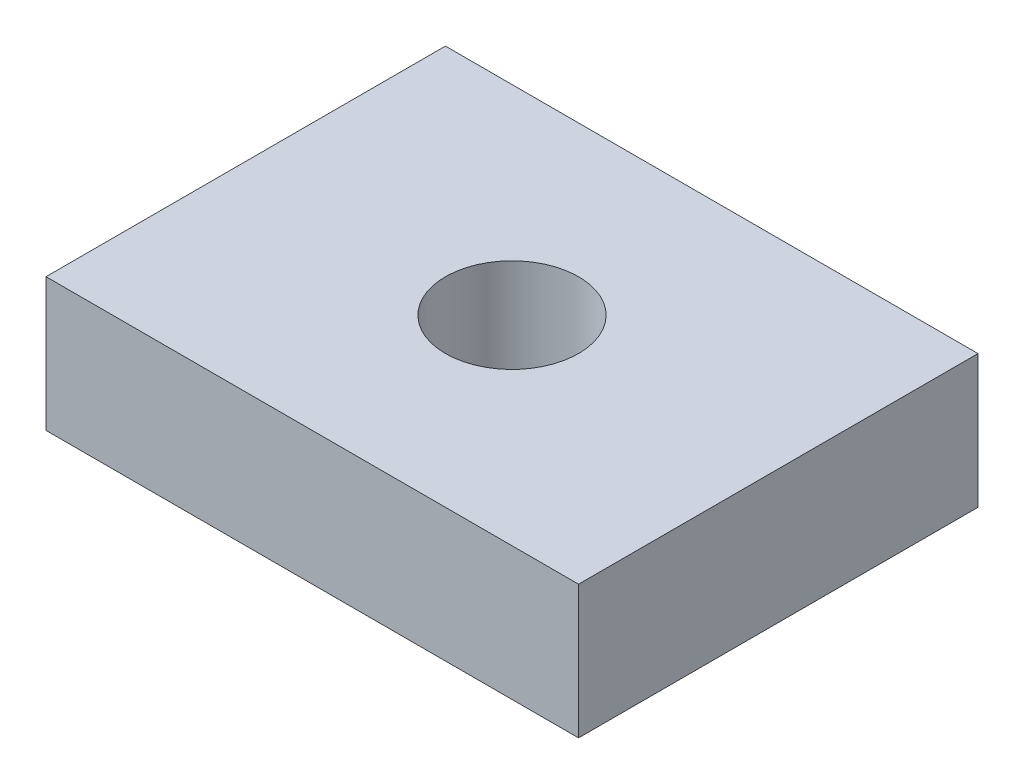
from build123d import *

# Parameters (mm, degrees)
BASESKETCH_W   = 80
BASESKETCH_H   = 60
BASEBOSS_DEPTH = 20
HOLESKETCH_R   = 10
HOLECUT_DEPTH  = 20


with BuildPart() as part:
    # BaseSketch → BaseBoss (new body)
    with BuildSketch(Plane(origin=(0, 0, 0), x_dir=(1, 0, 0), z_dir=(0, 1, 0))):
        with Locations((40, 30)):
            Rectangle(BASESKETCH_W, BASESKETCH_H)
    extrude(amount=-BASEBOSS_DEPTH)

    # HoleSketch → HoleCut (cut)
    with BuildSketch(Plane(origin=(0, 0, 0), x_dir=(1, 0, 0), z_dir=(0, 1, 0))):
        with Locations(Location((40, 30, 0), (0, 0, 270))):
            Circle(HOLESKETCH_R)
    extrude(amount=-HOLECUT_DEPTH, mode=Mode.SUBTRACT)


solid = part.part
